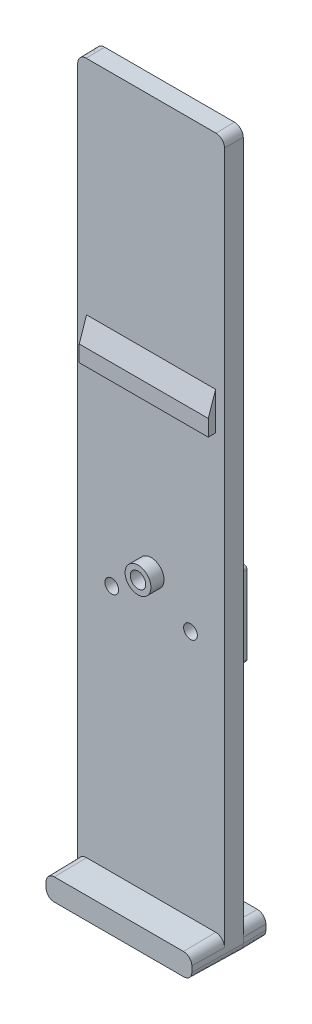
from build123d import *

# Parameters (mm, degrees)
BOSS_EXTRUDE1_DEPTH           = 3.175
BOSS_EXTRUDE1_TAPER           = 1
BOSS_EXTRUDE2_DEPTH           = 11.1125
BOSS_EXTRUDE3_DEPTH           = 5.5372
BOSS_EXTRUDE3_TAPER           = 1
BOSS_EXTRUDE4_DEPTH           = 3.9624
BOSS_EXTRUDE4_TAPER           = 1
SKETCH5_W                     = 3.9624
SKETCH5_H                     = 114.7572
CUT_EXTRUDE1_DEPTH            = 0.9398
CUT_EXTRUDE1_DRAFT            = -1
CUT_EXTRUDE1_PROFILE_2_DEPTH  = 0.9398
CUT_EXTRUDE1_PROFILE_2_DRAFT  = -1
BOSS_EXTRUDE5_DEPTH           = 3.175
BOSS_EXTRUDE5_TAPER           = 1
BOSS_EXTRUDE5_OTHER_WAY_DEPTH = 1.524
BOSS_EXTRUDE5_OTHER_WAY_TAPER = -1
SKETCH7_R                     = 1.1811
CUT_EXTRUDE2_DEPTH            = 65.065327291
FILLET1_R                     = 0.508
SKETCH8_R                     = 2.2225
BOSS_EXTRUDE6_DEPTH           = 2.2606
SKETCH9_R                     = 1.3335
CUT_EXTRUDE3_DEPTH            = 64.650475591


with BuildPart() as part:
    # Sketch1 → Boss-Extrude1 (new body)
    with BuildSketch(Plane.XY):
        with BuildLine():
            Line((-11.176, -61.6585), (11.176, -61.6585))
            ThreePointArc((11.176, -61.6585), (12.253630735, -61.212130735), (12.7, -60.1345))
            Line((12.7, -60.1345), (12.7, 60.1345))
            ThreePointArc((12.7, 60.1345), (12.253630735, 61.212130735), (11.176, 61.6585))
            Line((11.176, 61.6585), (-11.176, 61.6585))
            ThreePointArc((-11.176, 61.6585), (-12.253630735, 61.212130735), (-12.7, 60.1345))
            Line((-12.7, 60.1345), (-12.7, -60.1345))
            ThreePointArc((-12.7, -60.1345), (-12.253630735, -61.212130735), (-11.176, -61.6585))
        make_face()
    extrude(amount=BOSS_EXTRUDE1_DEPTH, taper=BOSS_EXTRUDE1_TAPER)

    # Sketch2 → Boss-Extrude2 (add, symmetric)
    with BuildSketch(Plane(origin=(0, 0, 0), x_dir=(0, 0, -1), z_dir=(1, 0, 0))):
        Polygon((-3.175, 16.848280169), (-3.175, 23.350680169), (-4.445, 19.642280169), (-4.445, 16.848280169), align=None)
    extrude(amount=BOSS_EXTRUDE2_DEPTH, both=True)

    # Sketch3 → Boss-Extrude3 (add)
    with BuildSketch(Plane.XY.offset(3.175)):
        with BuildLine():
            Line((-11.176, -61.603080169), (11.176, -61.603080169))
            ThreePointArc((11.176, -61.603080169), (12.214442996, -61.172942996), (12.644580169, -60.1345))
            Line((12.644580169, -60.1345), (12.644580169, -59.164680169))
            ThreePointArc((12.644580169, -59.164680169), (12.198210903, -58.087049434), (11.120580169, -57.640680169))
            Line((11.120580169, -57.640680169), (-11.120580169, -57.640680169))
            ThreePointArc((-11.120580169, -57.640680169), (-12.198210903, -58.087049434), (-12.644580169, -59.164680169))
            Line((-12.644580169, -59.164680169), (-12.644580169, -60.1345))
            ThreePointArc((-12.644580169, -60.1345), (-12.214442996, -61.172942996), (-11.176, -61.603080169))
        make_face()
    extrude(amount=BOSS_EXTRUDE3_DEPTH, taper=BOSS_EXTRUDE3_TAPER)

    # Sketch4 → Boss-Extrude4 (add)
    with BuildSketch(Plane(origin=(0, 0, 0), x_dir=(-1, 0, 0), z_dir=(0, 0, -1))):
        with BuildLine():
            ThreePointArc((11.176, -61.6585), (12.253630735, -61.212130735), (12.7, -60.1345))
            Line((12.7, -60.1345), (12.7, -59.2201))
            ThreePointArc((12.7, -59.2201), (12.253630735, -58.142469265), (11.176, -57.6961))
            Line((11.176, -57.6961), (-11.176, -57.6961))
            ThreePointArc((-11.176, -57.6961), (-12.253630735, -58.142469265), (-12.7, -59.2201))
            Line((-12.7, -59.2201), (-12.7, -60.1345))
            ThreePointArc((-12.7, -60.1345), (-12.253630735, -61.212130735), (-11.176, -61.6585))
            Line((-11.176, -61.6585), (11.176, -61.6585))
        make_face()
    extrude(amount=BOSS_EXTRUDE4_DEPTH, taper=BOSS_EXTRUDE4_TAPER)


with BuildPart() as cut_extrude1_tool:
    # Sketch5 → Cut-Extrude1 (with draft: the straight prism first)
    with BuildSketch(Plane(origin=(0, 0, 0), x_dir=(-1, 0, 0), z_dir=(0, 0, -1))):
        with Locations((-8.2423, 1.8415)):
            Rectangle(SKETCH5_W, SKETCH5_H)
    extrude(amount=-CUT_EXTRUDE1_DEPTH)
    # Cut-Extrude1: the draft: its side faces are tilted about the plane it starts from
    cut_extrude1_sides = [cut_extrude1_tool.faces().sort_by_distance(p)[0] for p in [
        (6.2611, 1.8415, 0.4699),
        (8.2423, 59.2201, 0.4699),
        (10.2235, 1.8415, 0.4699),
        (8.2423, -55.5371, 0.4699),
    ]]
    draft(cut_extrude1_sides, Plane(origin=(0, 0, 0), x_dir=(-1, 0, 0), z_dir=(0, 0, -1)), CUT_EXTRUDE1_DRAFT)


with BuildPart() as part_1:
    add(part.part)

    # Cut-Extrude1: cut by cut_extrude1_tool
    add(cut_extrude1_tool.part, mode=Mode.SUBTRACT)


with BuildPart() as cut_extrude1_profile_2_tool:
    # Sketch5 → Cut-Extrude1 profile 2 (with draft: the straight prism first)
    with BuildSketch(Plane(origin=(0, 0, 0), x_dir=(-1, 0, 0), z_dir=(0, 0, -1))):
        with Locations((8.2423, 1.8415)):
            Rectangle(SKETCH5_W, SKETCH5_H)
    extrude(amount=-CUT_EXTRUDE1_PROFILE_2_DEPTH)
    # Cut-Extrude1 profile 2: the draft: its side faces are tilted about the plane it starts from
    cut_extrude1_profile_2_sides = [cut_extrude1_profile_2_tool.faces().sort_by_distance(p)[0] for p in [
        (-8.2423, -55.5371, 0.4699),
        (-10.2235, 1.8415, 0.4699),
        (-8.2423, 59.2201, 0.4699),
        (-6.2611, 1.8415, 0.4699),
    ]]
    draft(cut_extrude1_profile_2_sides, Plane(origin=(0, 0, 0), x_dir=(-1, 0, 0), z_dir=(0, 0, -1)), CUT_EXTRUDE1_PROFILE_2_DRAFT)


with BuildPart() as part_2:
    add(part_1.part)

    # Cut-Extrude1 profile 2: cut by cut_extrude1_profile_2_tool
    add(cut_extrude1_profile_2_tool.part, mode=Mode.SUBTRACT)

    # Sketch6 → Boss-Extrude5 (add)
    with BuildSketch(Plane(origin=(0, 0, 0), x_dir=(-1, 0, 0), z_dir=(0, 0, -1))):
        with BuildLine():
            ThreePointArc((6.135243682, -6.6167), (0, -13.3223), (-6.135243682, -6.6167))
            Line((-6.135243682, -6.6167), (-10.2362, -6.6167))
            Line((-10.2362, -6.6167), (-10.2362, -21.1201))
            Line((-10.2362, -21.1201), (10.2362, -21.1201))
            Line((10.2362, -21.1201), (10.2362, -6.6167))
            Line((10.2362, -6.6167), (6.135243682, -6.6167))
        make_face()
    extrude(amount=BOSS_EXTRUDE5_DEPTH, taper=BOSS_EXTRUDE5_TAPER)

    # Sketch6 → Boss-Extrude5 other way (add)
    with BuildSketch(Plane(origin=(0, 0, 0), x_dir=(-1, 0, 0), z_dir=(0, 0, -1))):
        with BuildLine():
            ThreePointArc((6.135243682, -6.6167), (0, -13.3223), (-6.135243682, -6.6167))
            Line((-6.135243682, -6.6167), (-10.2362, -6.6167))
            Line((-10.2362, -6.6167), (-10.2362, -21.1201))
            Line((-10.2362, -21.1201), (10.2362, -21.1201))
            Line((10.2362, -21.1201), (10.2362, -6.6167))
            Line((10.2362, -6.6167), (6.135243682, -6.6167))
        make_face()
    extrude(amount=-BOSS_EXTRUDE5_OTHER_WAY_DEPTH, taper=BOSS_EXTRUDE5_OTHER_WAY_TAPER)

    # Sketch7 → Cut-Extrude2 (cut, through all)
    with BuildSketch(Plane(origin=(0, 0, -3.175), x_dir=(-1, 0, 0), z_dir=(0, 0, -1))):
        with Locations((-6.7818, -14.9479)):
            Circle(SKETCH7_R)
        with Locations((6.7818, -14.9479)):
            Circle(SKETCH7_R)
    extrude(amount=-CUT_EXTRUDE2_DEPTH, mode=Mode.SUBTRACT)

    # Fillet1
    fillet1_edges = [part_2.edges().sort_by_distance(p)[0] for p in [
        (10.208490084, -21.092390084, -1.5875),
        (-10.208490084, -21.092390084, -1.5875),
        (10.208490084, -6.644409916, -1.5875),
        (6.165381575, -6.644409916, -1.5875),
        (-6.165381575, -6.644409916, -1.5875),
        (-10.208490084, -6.644409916, -1.5875),
    ]]
    fillet(fillet1_edges, radius=FILLET1_R)

    # Sketch8 → Boss-Extrude6 (add)
    with BuildSketch(Plane.XY.offset(3.175)):
        with Locations(Location((0, -9.516108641, 0), (0, 0, 180))):
            Circle(SKETCH8_R)
    extrude(amount=BOSS_EXTRUDE6_DEPTH)

    # Sketch9 → Cut-Extrude3 (cut, through all)
    with BuildSketch(Plane.XY.offset(5.4356)):
        with Locations((0, -9.516108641)):
            Circle(SKETCH9_R)
    extrude(amount=-CUT_EXTRUDE3_DEPTH, mode=Mode.SUBTRACT)


solid = part_2.part
